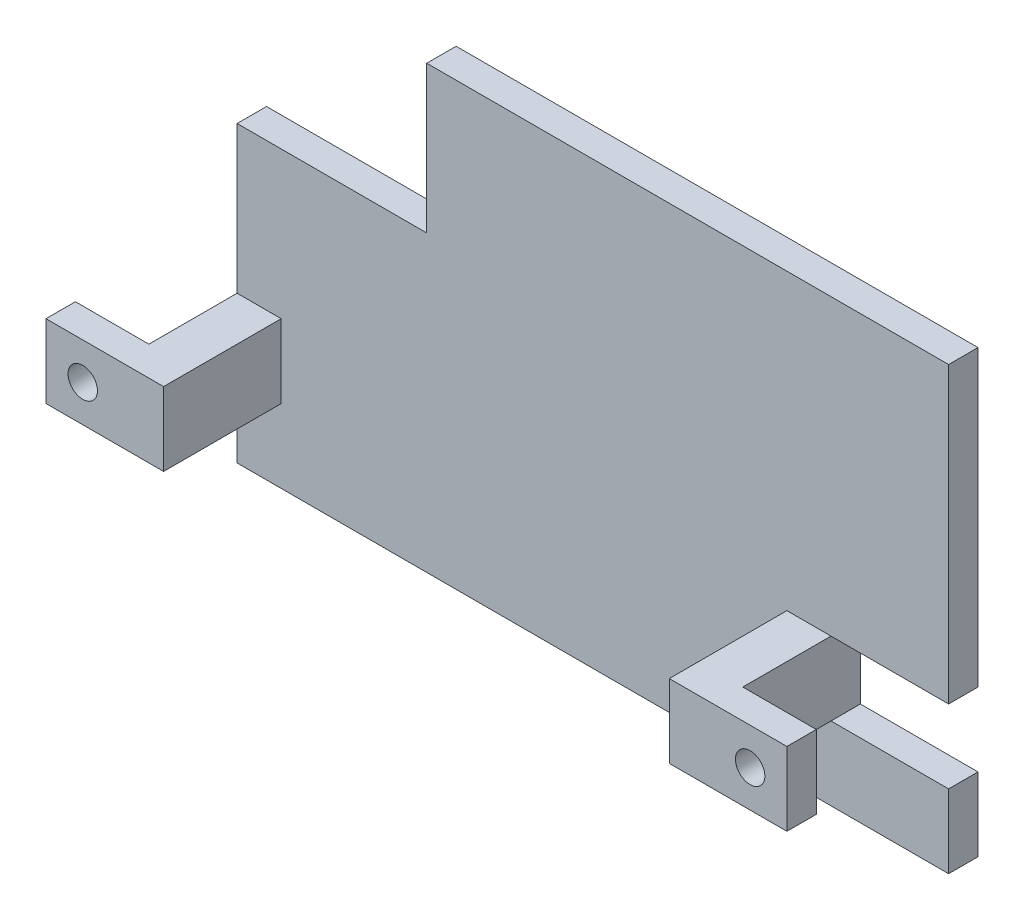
from build123d import *

# Parameters (mm, degrees)
CROQUIS1_W              = 48.4
CROQUIS1_H              = 30
SALIENTE_EXTRUIR1_DEPTH = 2
CROQUIS2_W              = 8
CROQUIS2_H              = 5
CORTAR_EXTRUIR1_DEPTH   = 2
CROQUIS3_W              = 3
CROQUIS3_H              = 5
SALIENTE_EXTRUIR2_DEPTH = 8
CROQUIS4_W              = 5
CROQUIS4_H              = 5
CROQUIS4_R              = 1
SALIENTE_EXTRUIR3_DEPTH = 2
CROQUIS7_W              = 12.9
CROQUIS7_H              = 10
CORTAR_EXTRUIR2_DEPTH   = 10


with BuildPart() as part:
    # Croquis1 → Saliente-Extruir1 (new body)
    with BuildSketch(Plane.XY):
        with Locations((23.812369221, -1.671019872)):
            Rectangle(CROQUIS1_W, CROQUIS1_H)
    extrude(amount=SALIENTE_EXTRUIR1_DEPTH)

    # Croquis2 → Cortar-Extruir1 (cut)
    with BuildSketch(Plane.XY.offset(2)):
        with Locations((44.012369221, -9.171019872)):
            Rectangle(CROQUIS2_W, CROQUIS2_H)
    extrude(amount=-CORTAR_EXTRUIR1_DEPTH, mode=Mode.SUBTRACT)

    # Croquis3 → Saliente-Extruir2 (add)
    with BuildSketch(Plane.XY.offset(2)):
        with Locations((38.512369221, -9.171019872)):
            Rectangle(CROQUIS3_W, CROQUIS3_H)
        with Locations((1.112369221, -9.171019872)):
            Rectangle(CROQUIS3_W, CROQUIS3_H)
    extrude(amount=SALIENTE_EXTRUIR2_DEPTH)

    # Croquis4 → Saliente-Extruir3 (add)
    # profile 1 of 2: a face of its own
    with BuildSketch(Plane.XY.offset(10)):
        with Locations((-2.887630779, -9.171019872)):
            Rectangle(CROQUIS4_W, CROQUIS4_H)
        with Locations((-2.887630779, -9.171019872)):
            Circle(CROQUIS4_R, mode=Mode.SUBTRACT)
    # profile 2 of 2: a face of its own
    with BuildSketch(Plane.XY.offset(10)):
        with Locations((42.512369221, -9.171019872)):
            Rectangle(CROQUIS4_W, CROQUIS4_H)
        with Locations((42.512369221, -9.171019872)):
            Circle(CROQUIS4_R, mode=Mode.SUBTRACT)
    extrude(amount=-SALIENTE_EXTRUIR3_DEPTH)

    # Croquis7 → Cortar-Extruir2 (cut)
    with BuildSketch(Plane(origin=(0, 0, 0), x_dir=(-1, 0, 0), z_dir=(0, 0, -1))):
        with Locations((-6.062369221, 8.328980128)):
            Rectangle(CROQUIS7_W, CROQUIS7_H)
    extrude(amount=-CORTAR_EXTRUIR2_DEPTH, mode=Mode.SUBTRACT)


solid = part.part
